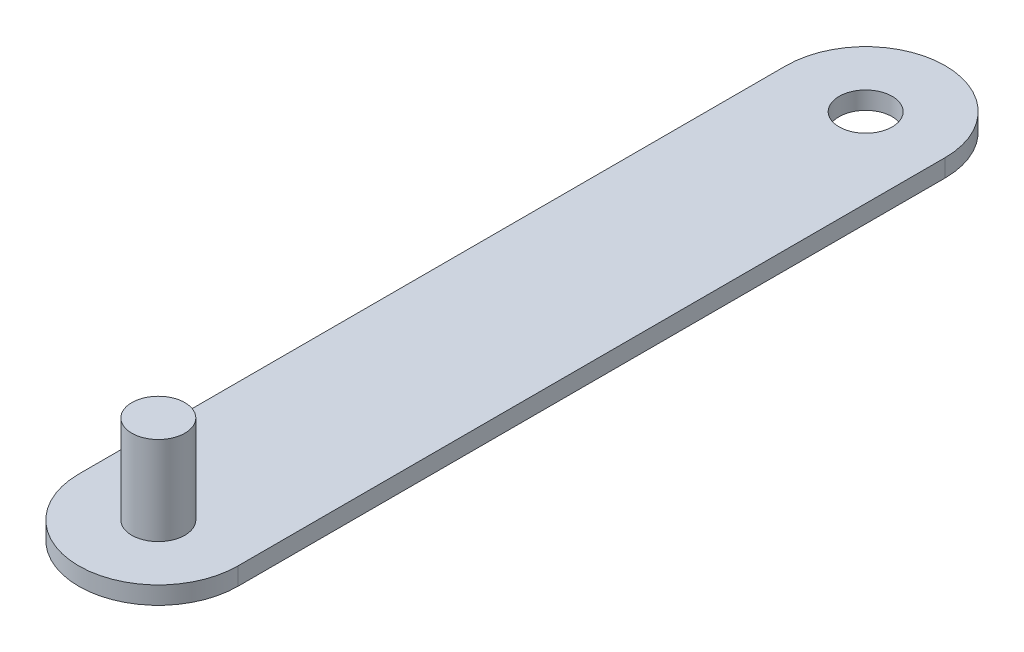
from build123d import *

# Parameters (mm, degrees)
SKETCH1_W           = 450
SKETCH1_H           = 2000
BOSS_EXTRUDE1_DEPTH = 50
BOSS_EXTRUDE2_DEPTH = 250
CUT_EXTRUDE2_DEPTH  = 250


with BuildPart() as part:
    # Sketch1 → Boss-Extrude1 (new body)
    with BuildSketch(Plane(origin=(0, 0, 0), x_dir=(1, 0, 0), z_dir=(0, 1, 0))):
        Rectangle(SKETCH1_W, SKETCH1_H)
        with BuildLine():
            Line((-225, 1000), (225, 1000))
            ThreePointArc((225, 1000), (0, 1225), (-225, 1000))
        make_face()
        with BuildLine():
            ThreePointArc((225, -1000), (0, -1225), (-225, -1000))
            Line((-225, -1000), (225, -1000))
        make_face()
    extrude(amount=BOSS_EXTRUDE1_DEPTH)

    # Sketch2 → Boss-Extrude2 (add)
    with BuildSketch(Plane(origin=(0, 50, 0), x_dir=(1, 0, 0), z_dir=(0, 1, 0))):
        with BuildLine():
            ThreePointArc((75, -1000), (0, -925), (-75, -1000))
            Line((-75, -1000), (75, -1000))
        make_face()
        with BuildLine():
            Line((75, -1000), (-75, -1000))
            ThreePointArc((-75, -1000), (0, -1075), (75, -1000))
        make_face()
        with BuildLine():
            ThreePointArc((75, -1000), (0, -925), (-75, -1000))
            Line((-75, -1000), (75, -1000))
        make_face()
        with BuildLine():
            Line((75, -1000), (-75, -1000))
            ThreePointArc((-75, -1000), (0, -1075), (75, -1000))
        make_face()
    extrude(amount=BOSS_EXTRUDE2_DEPTH)

    # Sketch3 → Cut-Extrude2 (cut)
    with BuildSketch(Plane(origin=(0, 50, 0), x_dir=(1, 0, 0), z_dir=(0, 1, 0))):
        with BuildLine():
            ThreePointArc((75, 1000), (0, 1075), (-75, 1000))
            Line((-75, 1000), (75, 1000))
        make_face()
        with BuildLine():
            Line((75, 1000), (-75, 1000))
            ThreePointArc((-75, 1000), (0, 925), (75, 1000))
        make_face()
        with BuildLine():
            ThreePointArc((75, 1000), (0, 1075), (-75, 1000))
            Line((-75, 1000), (75, 1000))
        make_face()
        with BuildLine():
            Line((75, 1000), (-75, 1000))
            ThreePointArc((-75, 1000), (0, 925), (75, 1000))
        make_face()
    extrude(amount=-CUT_EXTRUDE2_DEPTH, mode=Mode.SUBTRACT)


solid = part.part
